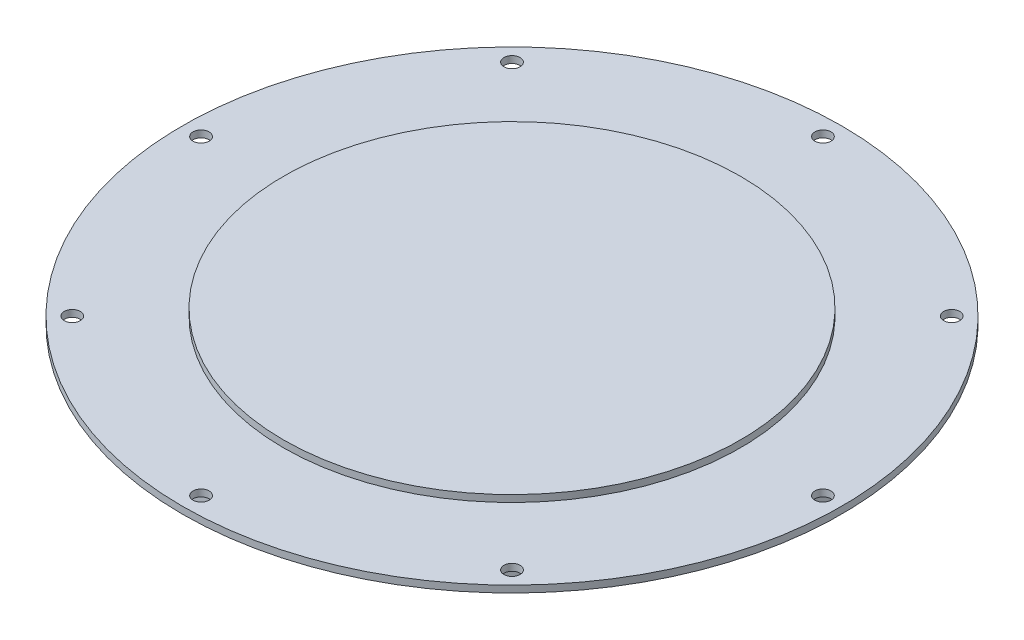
from build123d import *

# Parameters (mm, degrees)
FILLET1_R                       = 0.254
F_9_32_0_28125_DIAMETER_HOLE1_D = 7.14375
CIRPATTERN1_COUNT               = 8


with BuildPart() as part:
    # Sketch1 → Revolve1 (revolve)
    with BuildSketch(Plane.XY, mode=Mode.PRIVATE) as revolve1_sk:
        with BuildLine():
            Line((0, 3.048), (-101.2317, 3.048))
            Line((-101.2317, 3.048), (-101.2317, 0))
            Line((-101.2317, 0), (-103.3907, 0))
            Line((-103.3907, 0), (-109.5375, -3.548856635))
            Line((-109.5375, -3.548856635), (-109.5375, -12.326077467))
            ThreePointArc((-109.5375, -12.326077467), (-109.2835, -12.894038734), (-109.5375, -13.462))
            Line((-109.5375, -13.462), (-109.5375, -14.732))
            Line((-109.5375, -14.732), (0, -14.732))
            Line((0, -14.732), (0, 3.048))
        make_face()
    revolve(revolve1_sk.sketch.rotate(Axis((0, 3.048, 0), (0, 1, 0)), 270), axis=Axis((0, 3.048, 0), (0, 1, 0)))

    # Fillet1
    fillet1_edges = [part.edges().sort_by_distance(p)[0] for p in [
        (0, -12.326077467, 109.5375),
        (0, -13.462, 109.5375),
        (0, -14.732, 109.5375),
    ]]
    fillet(fillet1_edges, radius=FILLET1_R)

    # Sketch2 → Revolve2 (revolve)
    with BuildSketch(Plane.XY, mode=Mode.PRIVATE) as revolve2_sk:
        Polygon((-103.3907, 0), (-146.05, 0), (-146.05, -3.048), (-127, -3.048), (-127, -15.748), (-125.73, -15.748), (-103.3907, -14.732), align=None)
    revolve(revolve2_sk.sketch.rotate(Axis((0, 0, 0), (0, -1, 0)), 270), axis=Axis((0, 0, 0), (0, -1, 0)))

    # 9_32 _0.28125_ Diameter Hole1 (through all)
    with Locations(Plane(origin=(0, -3.048, 0), x_dir=(-1, 0, 0), z_dir=(0, -1, 0))):
        with Locations((137.795, 0)):
            f_9_32_0_28125_diameter_hole1 = Hole(F_9_32_0_28125_DIAMETER_HOLE1_D / 2)

    # CirPattern1: 9_32 _0.28125_ Diameter Hole1 ×8 about axis
    cirpattern1_axis = Axis((0, 0, 0), (0, 1, 0))
    for i in range(1, CIRPATTERN1_COUNT):
        add(f_9_32_0_28125_diameter_hole1.rotate(cirpattern1_axis, i * 360 / CIRPATTERN1_COUNT), mode=Mode.SUBTRACT)


solid = part.part
